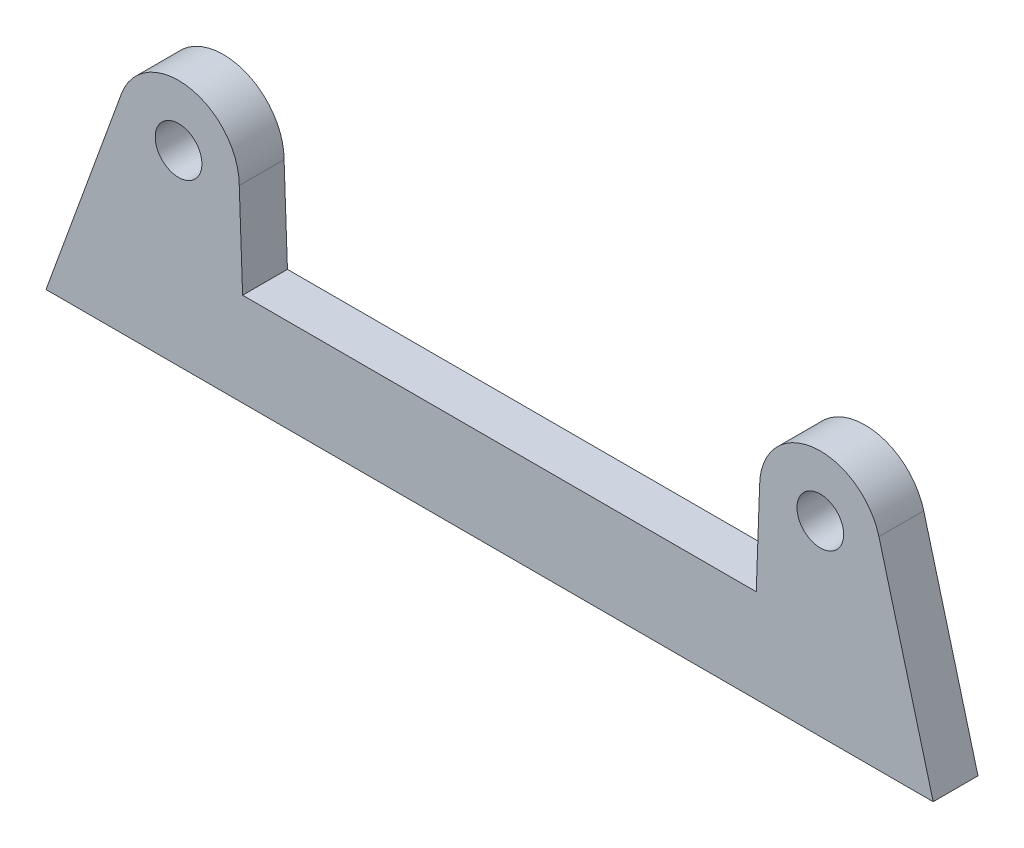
from build123d import *

# Parameters (mm, degrees)
SKETCH2_R      = 3.175
EXTRUDE1_DEPTH = 6.096


with BuildPart() as part:
    # Sketch2 → Extrude1 (new body)
    with BuildSketch(Plane.XY):
        with BuildLine():
            Line((0, 0), (120.65, 0))
            Line((120.65, 0), (113.273804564, 27.528336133))
            ThreePointArc((113.273804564, 27.528336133), (104.222593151, 33.576162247), (97.045086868, 25.391784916))
            Line((97.045086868, 25.391784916), (96.588364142, 12.7))
            Line((96.588364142, 12.7), (26.738364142, 12.7))
            Line((26.738364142, 12.7), (26.281641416, 25.391784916))
            ThreePointArc((26.281641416, 25.391784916), (19.460107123, 33.521372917), (10.269478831, 28.215161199))
            Line((10.269478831, 28.215161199), (0, 0))
        make_face()
        with Locations((18.026641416, 25.391784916)):
            Circle(SKETCH2_R, mode=Mode.SUBTRACT)
        with Locations((105.300086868, 25.391784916)):
            Circle(SKETCH2_R, mode=Mode.SUBTRACT)
    extrude(amount=-EXTRUDE1_DEPTH)


solid = part.part
